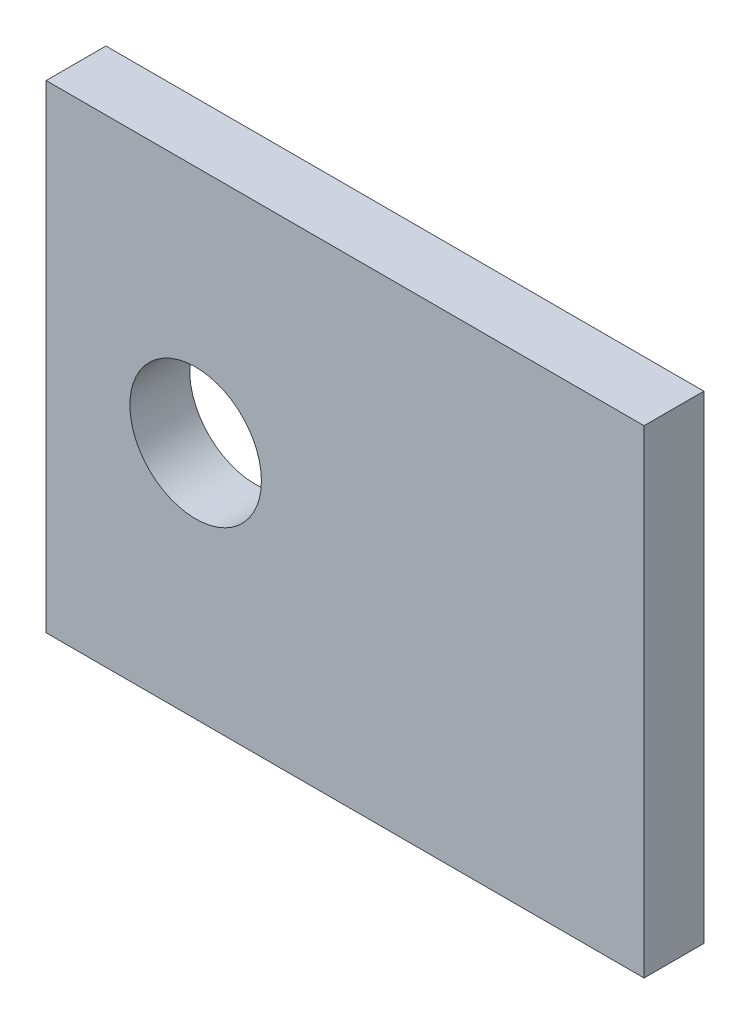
ISO-10303-21;
HEADER;
FILE_DESCRIPTION(('STEP AP214'),'2;1');
FILE_NAME('part.step','',(''),(''),'','','');
FILE_SCHEMA(('AUTOMOTIVE_DESIGN { 1 0 10303 214 1 1 1 1 }'));
ENDSEC;
DATA;
#1=APPLICATION_CONTEXT('core data for automotive mechanical design processes');
#2=APPLICATION_PROTOCOL_DEFINITION('international standard','automotive_design',2000,#1);
#3=PRODUCT_CONTEXT('',#1,'mechanical');
#4=PRODUCT('Part','Part','',(#3));
#5=PRODUCT_RELATED_PRODUCT_CATEGORY('part','',(#4));
#6=PRODUCT_DEFINITION_FORMATION('','',#4);
#7=PRODUCT_DEFINITION_CONTEXT('part definition',#1,'design');
#8=PRODUCT_DEFINITION('design','',#6,#7);
#9=PRODUCT_DEFINITION_SHAPE('','',#8);
#10=(LENGTH_UNIT() NAMED_UNIT(*) SI_UNIT(.MILLI.,.METRE.));
#11=(NAMED_UNIT(*) PLANE_ANGLE_UNIT() SI_UNIT($,.RADIAN.));
#12=(NAMED_UNIT(*) SI_UNIT($,.STERADIAN.) SOLID_ANGLE_UNIT());
#13=UNCERTAINTY_MEASURE_WITH_UNIT(LENGTH_MEASURE(1.E-05),#10,'distance_accuracy_value','');
#14=(GEOMETRIC_REPRESENTATION_CONTEXT(3) GLOBAL_UNCERTAINTY_ASSIGNED_CONTEXT((#13)) GLOBAL_UNIT_ASSIGNED_CONTEXT((#10,
#11,#12)) REPRESENTATION_CONTEXT('',''));
#15=CARTESIAN_POINT('',(0.,0.,0.));
#16=DIRECTION('',(0.,0.,1.));
#17=DIRECTION('',(1.,0.,0.));
#18=AXIS2_PLACEMENT_3D('',#15,#16,#17);
#19=CARTESIAN_POINT('',(0.,80.,0.));
#20=DIRECTION('',(0.,0.,-1.));
#21=DIRECTION('',(-1.,0.,0.));
#22=AXIS2_PLACEMENT_3D('',#19,#20,#21);
#23=PLANE('',#22);
#24=DIRECTION('',(0.,-1.,0.));
#25=VECTOR('',#24,1.);
#26=CARTESIAN_POINT('',(0.,0.,0.));
#27=LINE('',#26,#25);
#28=CARTESIAN_POINT('',(0.,80.,0.));
#29=VERTEX_POINT('',#28);
#30=CARTESIAN_POINT('',(0.,0.,0.));
#31=VERTEX_POINT('',#30);
#32=EDGE_CURVE('E77',#29,#31,#27,.T.);
#33=ORIENTED_EDGE('',*,*,#32,.F.);
#34=DIRECTION('',(-1.,0.,0.));
#35=VECTOR('',#34,1.);
#36=CARTESIAN_POINT('',(0.,80.,0.));
#37=LINE('',#36,#35);
#38=CARTESIAN_POINT('',(100.,80.,0.));
#39=VERTEX_POINT('',#38);
#40=EDGE_CURVE('E98',#39,#29,#37,.T.);
#41=ORIENTED_EDGE('',*,*,#40,.F.);
#42=DIRECTION('',(0.,1.,0.));
#43=VECTOR('',#42,1.);
#44=CARTESIAN_POINT('',(100.,0.,0.));
#45=LINE('',#44,#43);
#46=CARTESIAN_POINT('',(100.,0.,0.));
#47=VERTEX_POINT('',#46);
#48=EDGE_CURVE('E78',#47,#39,#45,.T.);
#49=ORIENTED_EDGE('',*,*,#48,.F.);
#50=DIRECTION('',(1.,0.,0.));
#51=VECTOR('',#50,1.);
#52=CARTESIAN_POINT('',(0.,0.,0.));
#53=LINE('',#52,#51);
#54=EDGE_CURVE('E73',#31,#47,#53,.T.);
#55=ORIENTED_EDGE('',*,*,#54,.F.);
#56=EDGE_LOOP('',(#33,#41,#49,#55));
#57=FACE_BOUND('',#56,.T.);
#58=CARTESIAN_POINT('',(25.,40.,0.));
#59=DIRECTION('',(0.,0.,1.));
#60=DIRECTION('',(1.,0.,0.));
#61=AXIS2_PLACEMENT_3D('',#58,#59,#60);
#62=CIRCLE('',#61,11.);
#63=CARTESIAN_POINT('',(36.,40.,0.));
#64=VERTEX_POINT('',#63);
#65=EDGE_CURVE('E93',#64,#64,#62,.T.);
#66=ORIENTED_EDGE('',*,*,#65,.T.);
#67=EDGE_LOOP('',(#66));
#68=FACE_BOUND('',#67,.T.);
#69=ADVANCED_FACE('F32',(#57,#68),#23,.T.);
#70=CARTESIAN_POINT('',(0.,0.,10.));
#71=DIRECTION('',(1.,0.,0.));
#72=DIRECTION('',(0.,0.,-1.));
#73=AXIS2_PLACEMENT_3D('',#70,#71,#72);
#74=PLANE('',#73);
#75=ORIENTED_EDGE('',*,*,#32,.T.);
#76=DIRECTION('',(0.,0.,-1.));
#77=VECTOR('',#76,1.);
#78=CARTESIAN_POINT('',(0.,0.,10.));
#79=LINE('',#78,#77);
#80=CARTESIAN_POINT('',(0.,0.,10.));
#81=VERTEX_POINT('',#80);
#82=EDGE_CURVE('E11',#81,#31,#79,.T.);
#83=ORIENTED_EDGE('',*,*,#82,.F.);
#84=DIRECTION('',(0.,-1.,0.));
#85=VECTOR('',#84,1.);
#86=CARTESIAN_POINT('',(0.,0.,10.));
#87=LINE('',#86,#85);
#88=CARTESIAN_POINT('',(0.,80.,10.));
#89=VERTEX_POINT('',#88);
#90=EDGE_CURVE('E100',#89,#81,#87,.T.);
#91=ORIENTED_EDGE('',*,*,#90,.F.);
#92=DIRECTION('',(0.,0.,-1.));
#93=VECTOR('',#92,1.);
#94=CARTESIAN_POINT('',(0.,80.,10.));
#95=LINE('',#94,#93);
#96=EDGE_CURVE('E89',#89,#29,#95,.T.);
#97=ORIENTED_EDGE('',*,*,#96,.T.);
#98=EDGE_LOOP('',(#75,#83,#91,#97));
#99=FACE_BOUND('',#98,.T.);
#100=ADVANCED_FACE('F34',(#99),#74,.F.);
#101=CARTESIAN_POINT('',(0.,0.,10.));
#102=DIRECTION('',(0.,1.,0.));
#103=DIRECTION('',(0.,0.,1.));
#104=AXIS2_PLACEMENT_3D('',#101,#102,#103);
#105=PLANE('',#104);
#106=ORIENTED_EDGE('',*,*,#54,.T.);
#107=DIRECTION('',(0.,0.,-1.));
#108=VECTOR('',#107,1.);
#109=CARTESIAN_POINT('',(100.,0.,10.));
#110=LINE('',#109,#108);
#111=CARTESIAN_POINT('',(100.,0.,10.));
#112=VERTEX_POINT('',#111);
#113=EDGE_CURVE('E40',#112,#47,#110,.T.);
#114=ORIENTED_EDGE('',*,*,#113,.F.);
#115=DIRECTION('',(1.,0.,0.));
#116=VECTOR('',#115,1.);
#117=CARTESIAN_POINT('',(0.,0.,10.));
#118=LINE('',#117,#116);
#119=EDGE_CURVE('E85',#81,#112,#118,.T.);
#120=ORIENTED_EDGE('',*,*,#119,.F.);
#121=ORIENTED_EDGE('',*,*,#82,.T.);
#122=EDGE_LOOP('',(#106,#114,#120,#121));
#123=FACE_BOUND('',#122,.T.);
#124=ADVANCED_FACE('F84',(#123),#105,.F.);
#125=CARTESIAN_POINT('',(100.,0.,10.));
#126=DIRECTION('',(-1.,0.,0.));
#127=DIRECTION('',(0.,0.,1.));
#128=AXIS2_PLACEMENT_3D('',#125,#126,#127);
#129=PLANE('',#128);
#130=ORIENTED_EDGE('',*,*,#48,.T.);
#131=DIRECTION('',(0.,0.,-1.));
#132=VECTOR('',#131,1.);
#133=CARTESIAN_POINT('',(100.,80.,10.));
#134=LINE('',#133,#132);
#135=CARTESIAN_POINT('',(100.,80.,10.));
#136=VERTEX_POINT('',#135);
#137=EDGE_CURVE('E106',#136,#39,#134,.T.);
#138=ORIENTED_EDGE('',*,*,#137,.F.);
#139=DIRECTION('',(0.,1.,0.));
#140=VECTOR('',#139,1.);
#141=CARTESIAN_POINT('',(100.,0.,10.));
#142=LINE('',#141,#140);
#143=EDGE_CURVE('E52',#112,#136,#142,.T.);
#144=ORIENTED_EDGE('',*,*,#143,.F.);
#145=ORIENTED_EDGE('',*,*,#113,.T.);
#146=EDGE_LOOP('',(#130,#138,#144,#145));
#147=FACE_BOUND('',#146,.T.);
#148=ADVANCED_FACE('F109',(#147),#129,.F.);
#149=CARTESIAN_POINT('',(0.,80.,10.));
#150=DIRECTION('',(0.,-1.,0.));
#151=DIRECTION('',(0.,0.,-1.));
#152=AXIS2_PLACEMENT_3D('',#149,#150,#151);
#153=PLANE('',#152);
#154=ORIENTED_EDGE('',*,*,#40,.T.);
#155=ORIENTED_EDGE('',*,*,#96,.F.);
#156=DIRECTION('',(-1.,0.,0.));
#157=VECTOR('',#156,1.);
#158=CARTESIAN_POINT('',(0.,80.,10.));
#159=LINE('',#158,#157);
#160=EDGE_CURVE('E47',#136,#89,#159,.T.);
#161=ORIENTED_EDGE('',*,*,#160,.F.);
#162=ORIENTED_EDGE('',*,*,#137,.T.);
#163=EDGE_LOOP('',(#154,#155,#161,#162));
#164=FACE_BOUND('',#163,.T.);
#165=ADVANCED_FACE('F111',(#164),#153,.F.);
#166=CARTESIAN_POINT('',(0.,80.,10.));
#167=DIRECTION('',(0.,0.,-1.));
#168=DIRECTION('',(-1.,0.,0.));
#169=AXIS2_PLACEMENT_3D('',#166,#167,#168);
#170=PLANE('',#169);
#171=CARTESIAN_POINT('',(25.,40.,10.));
#172=DIRECTION('',(0.,0.,1.));
#173=DIRECTION('',(1.,0.,0.));
#174=AXIS2_PLACEMENT_3D('',#171,#172,#173);
#175=CIRCLE('',#174,11.);
#176=CARTESIAN_POINT('',(36.,40.,10.));
#177=VERTEX_POINT('',#176);
#178=EDGE_CURVE('E90',#177,#177,#175,.T.);
#179=ORIENTED_EDGE('',*,*,#178,.F.);
#180=EDGE_LOOP('',(#179));
#181=FACE_BOUND('',#180,.T.);
#182=ORIENTED_EDGE('',*,*,#90,.T.);
#183=ORIENTED_EDGE('',*,*,#119,.T.);
#184=ORIENTED_EDGE('',*,*,#143,.T.);
#185=ORIENTED_EDGE('',*,*,#160,.T.);
#186=EDGE_LOOP('',(#182,#183,#184,#185));
#187=FACE_BOUND('',#186,.T.);
#188=ADVANCED_FACE('F112',(#181,#187),#170,.F.);
#189=CARTESIAN_POINT('',(25.,40.,10.));
#190=DIRECTION('',(0.,0.,1.));
#191=DIRECTION('',(1.,0.,0.));
#192=AXIS2_PLACEMENT_3D('',#189,#190,#191);
#193=CYLINDRICAL_SURFACE('',#192,11.);
#194=ORIENTED_EDGE('',*,*,#65,.F.);
#195=EDGE_LOOP('',(#194));
#196=FACE_BOUND('',#195,.T.);
#197=ORIENTED_EDGE('',*,*,#178,.T.);
#198=EDGE_LOOP('',(#197));
#199=FACE_BOUND('',#198,.T.);
#200=ADVANCED_FACE('F114',(#196,#199),#193,.F.);
#201=CLOSED_SHELL('',(#69,#100,#124,#148,#165,#188,#200));
#202=MANIFOLD_SOLID_BREP('B2',#201);
#203=ADVANCED_BREP_SHAPE_REPRESENTATION('',(#18,#202),#14);
#204=SHAPE_DEFINITION_REPRESENTATION(#9,#203);
ENDSEC;
END-ISO-10303-21;
